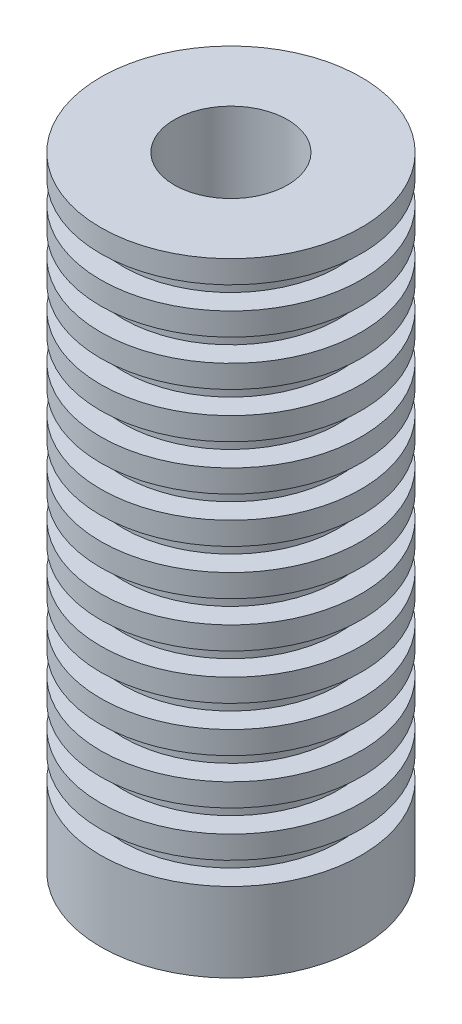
from build123d import *

# Parameters (mm, degrees)
SKETCH1_R                     = 5.75
POWER_CYLINDER_OD_DEPTH       = 13.75
POWER_CYLIDER_BORE_DEPTH      = 16.974589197
POWER_CYLIDER_BORE_DEPTH_BACK = 16.974589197
SKETCH2_R                     = 2.5
SKETCH4_W                     = 1
SKETCH4_H                     = 1
LPATTERN1_COUNT               = 12
LPATTERN1_PITCH               = 2


with BuildPart() as part:
    # Sketch1 → power cylinder OD (new, symmetric)
    with BuildSketch(Plane(origin=(0, 0, 0), x_dir=(1, 0, 0), z_dir=(0, 1, 0))):
        with Locations(Location((0, 0, 0), (0, 0, 270))):
            Circle(SKETCH1_R)
    extrude(amount=POWER_CYLINDER_OD_DEPTH, both=True)

    # Sketch2 → power cylider bore (cut, two sides: drawn at the far end of the back side and taken through both)
    with BuildSketch(Plane(origin=(0, 0, 0), x_dir=(1, 0, 0), z_dir=(0, 1, 0)).offset(-POWER_CYLIDER_BORE_DEPTH_BACK)):
        with Locations(Location((0, 0, 0), (0, 0, 270))):
            Circle(SKETCH2_R)
    extrude(amount=POWER_CYLIDER_BORE_DEPTH + POWER_CYLIDER_BORE_DEPTH_BACK, mode=Mode.SUBTRACT)

    # Sketch4 → Cut-Revolve1 (revolve, cut)
    with BuildSketch(Plane.XY, mode=Mode.PRIVATE) as cut_revolve1_sk:
        with Locations((5.25, -9.75)):
            Rectangle(SKETCH4_W, SKETCH4_H)
    cut_revolve1 = revolve(cut_revolve1_sk.sketch.rotate(Axis((0, 13.75, 0), (0, -1, 0)), 90), axis=Axis((0, 13.75, 0), (0, -1, 0)), mode=Mode.SUBTRACT)

    # LPattern1: Cut-Revolve1 ×12
    with Locations(*[(0, i * LPATTERN1_PITCH, 0) for i in range(1, LPATTERN1_COUNT)]):
        add(cut_revolve1, mode=Mode.SUBTRACT)


solid = part.part
